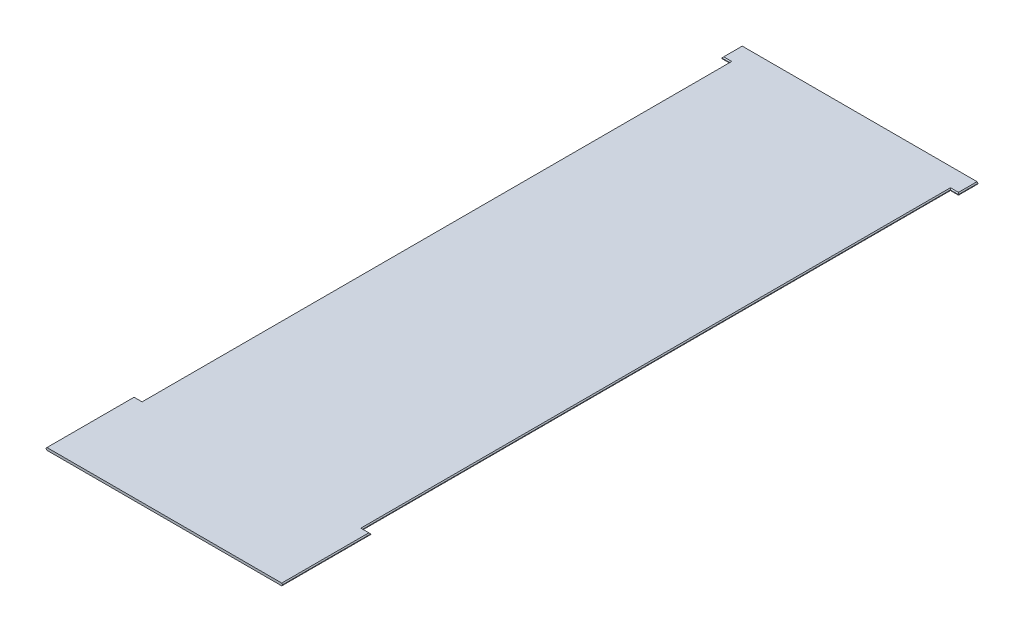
ISO-10303-21;
HEADER;
FILE_DESCRIPTION(('STEP AP214'),'2;1');
FILE_NAME('part.step','',(''),(''),'','','');
FILE_SCHEMA(('AUTOMOTIVE_DESIGN { 1 0 10303 214 1 1 1 1 }'));
ENDSEC;
DATA;
#1=APPLICATION_CONTEXT('core data for automotive mechanical design processes');
#2=APPLICATION_PROTOCOL_DEFINITION('international standard','automotive_design',2000,#1);
#3=PRODUCT_CONTEXT('',#1,'mechanical');
#4=PRODUCT('Part','Part','',(#3));
#5=PRODUCT_RELATED_PRODUCT_CATEGORY('part','',(#4));
#6=PRODUCT_DEFINITION_FORMATION('','',#4);
#7=PRODUCT_DEFINITION_CONTEXT('part definition',#1,'design');
#8=PRODUCT_DEFINITION('design','',#6,#7);
#9=PRODUCT_DEFINITION_SHAPE('','',#8);
#10=(LENGTH_UNIT() NAMED_UNIT(*) SI_UNIT(.MILLI.,.METRE.));
#11=(NAMED_UNIT(*) PLANE_ANGLE_UNIT() SI_UNIT($,.RADIAN.));
#12=(NAMED_UNIT(*) SI_UNIT($,.STERADIAN.) SOLID_ANGLE_UNIT());
#13=UNCERTAINTY_MEASURE_WITH_UNIT(LENGTH_MEASURE(1.E-05),#10,'distance_accuracy_value','');
#14=(GEOMETRIC_REPRESENTATION_CONTEXT(3) GLOBAL_UNCERTAINTY_ASSIGNED_CONTEXT((#13)) GLOBAL_UNIT_ASSIGNED_CONTEXT((#10,
#11,#12)) REPRESENTATION_CONTEXT('',''));
#15=CARTESIAN_POINT('',(0.,0.,0.));
#16=DIRECTION('',(0.,0.,1.));
#17=DIRECTION('',(1.,0.,0.));
#18=AXIS2_PLACEMENT_3D('',#15,#16,#17);
#19=CARTESIAN_POINT('',(553.261641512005,6.35,1566.92811259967));
#20=DIRECTION('',(-1.,0.,0.));
#21=DIRECTION('',(0.,0.,1.));
#22=AXIS2_PLACEMENT_3D('',#19,#20,#21);
#23=PLANE('',#22);
#24=DIRECTION('',(0.,-1.,0.));
#25=VECTOR('',#24,1.);
#26=CARTESIAN_POINT('',(553.261641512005,6.35,2018.12811259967));
#27=LINE('',#26,#25);
#28=CARTESIAN_POINT('',(553.261641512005,1.34999999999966,2018.12811259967));
#29=VERTEX_POINT('',#28);
#30=CARTESIAN_POINT('',(553.261641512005,-1.35000000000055,2018.12811259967));
#31=VERTEX_POINT('',#30);
#32=EDGE_CURVE('E236',#29,#31,#27,.T.);
#33=ORIENTED_EDGE('',*,*,#32,.T.);
#34=DIRECTION('',(0.,0.,-1.));
#35=VECTOR('',#34,1.);
#36=CARTESIAN_POINT('',(553.261641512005,-1.35000000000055,1566.92811259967));
#37=LINE('',#36,#35);
#38=CARTESIAN_POINT('',(553.261641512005,-1.35000000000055,1566.92811259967));
#39=VERTEX_POINT('',#38);
#40=EDGE_CURVE('E11',#31,#39,#37,.T.);
#41=ORIENTED_EDGE('',*,*,#40,.T.);
#42=DIRECTION('',(0.,-1.,0.));
#43=VECTOR('',#42,1.);
#44=CARTESIAN_POINT('',(553.261641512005,6.35,1566.92811259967));
#45=LINE('',#44,#43);
#46=CARTESIAN_POINT('',(553.261641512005,1.34999999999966,1566.92811259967));
#47=VERTEX_POINT('',#46);
#48=EDGE_CURVE('E243',#47,#39,#45,.T.);
#49=ORIENTED_EDGE('',*,*,#48,.F.);
#50=DIRECTION('',(0.,0.,1.));
#51=VECTOR('',#50,1.);
#52=CARTESIAN_POINT('',(553.261641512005,1.34999999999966,1566.92811259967));
#53=LINE('',#52,#51);
#54=EDGE_CURVE('E59',#47,#29,#53,.T.);
#55=ORIENTED_EDGE('',*,*,#54,.T.);
#56=EDGE_LOOP('',(#33,#41,#49,#55));
#57=FACE_BOUND('',#56,.T.);
#58=ADVANCED_FACE('F50',(#57),#23,.F.);
#59=CARTESIAN_POINT('',(512.161641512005,6.35,1566.92811259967));
#60=DIRECTION('',(0.,0.,1.));
#61=DIRECTION('',(1.,0.,0.));
#62=AXIS2_PLACEMENT_3D('',#59,#60,#61);
#63=PLANE('',#62);
#64=ORIENTED_EDGE('',*,*,#48,.T.);
#65=DIRECTION('',(-1.,0.,0.));
#66=VECTOR('',#65,1.);
#67=CARTESIAN_POINT('',(512.161641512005,-1.35000000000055,1566.92811259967));
#68=LINE('',#67,#66);
#69=CARTESIAN_POINT('',(512.161641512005,-1.35000000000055,1566.92811259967));
#70=VERTEX_POINT('',#69);
#71=EDGE_CURVE('E380',#39,#70,#68,.T.);
#72=ORIENTED_EDGE('',*,*,#71,.T.);
#73=DIRECTION('',(0.,-1.,0.));
#74=VECTOR('',#73,1.);
#75=CARTESIAN_POINT('',(512.161641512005,6.35,1566.92811259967));
#76=LINE('',#75,#74);
#77=CARTESIAN_POINT('',(512.161641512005,1.34999999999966,1566.92811259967));
#78=VERTEX_POINT('',#77);
#79=EDGE_CURVE('E248',#78,#70,#76,.T.);
#80=ORIENTED_EDGE('',*,*,#79,.F.);
#81=DIRECTION('',(1.,0.,0.));
#82=VECTOR('',#81,1.);
#83=CARTESIAN_POINT('',(512.161641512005,1.34999999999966,1566.92811259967));
#84=LINE('',#83,#82);
#85=EDGE_CURVE('E73',#78,#47,#84,.T.);
#86=ORIENTED_EDGE('',*,*,#85,.T.);
#87=EDGE_LOOP('',(#64,#72,#80,#86));
#88=FACE_BOUND('',#87,.T.);
#89=ADVANCED_FACE('F620',(#88),#63,.F.);
#90=CARTESIAN_POINT('',(512.161641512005,6.35,-1445.07188740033));
#91=DIRECTION('',(-1.,0.,0.));
#92=DIRECTION('',(0.,0.,1.));
#93=AXIS2_PLACEMENT_3D('',#90,#91,#92);
#94=PLANE('',#93);
#95=ORIENTED_EDGE('',*,*,#79,.T.);
#96=DIRECTION('',(0.,0.,-1.));
#97=VECTOR('',#96,1.);
#98=CARTESIAN_POINT('',(512.161641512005,-1.35000000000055,-1445.07188740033));
#99=LINE('',#98,#97);
#100=CARTESIAN_POINT('',(512.161641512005,-1.35000000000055,-1445.07188740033));
#101=VERTEX_POINT('',#100);
#102=EDGE_CURVE('E375',#70,#101,#99,.T.);
#103=ORIENTED_EDGE('',*,*,#102,.T.);
#104=DIRECTION('',(0.,-1.,0.));
#105=VECTOR('',#104,1.);
#106=CARTESIAN_POINT('',(512.161641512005,6.35,-1445.07188740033));
#107=LINE('',#106,#105);
#108=CARTESIAN_POINT('',(512.161641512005,1.34999999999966,-1445.07188740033));
#109=VERTEX_POINT('',#108);
#110=EDGE_CURVE('E493',#109,#101,#107,.T.);
#111=ORIENTED_EDGE('',*,*,#110,.F.);
#112=DIRECTION('',(0.,0.,1.));
#113=VECTOR('',#112,1.);
#114=CARTESIAN_POINT('',(512.161641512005,1.34999999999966,-1445.07188740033));
#115=LINE('',#114,#113);
#116=EDGE_CURVE('E367',#109,#78,#115,.T.);
#117=ORIENTED_EDGE('',*,*,#116,.T.);
#118=EDGE_LOOP('',(#95,#103,#111,#117));
#119=FACE_BOUND('',#118,.T.);
#120=ADVANCED_FACE('F498',(#119),#94,.F.);
#121=CARTESIAN_POINT('',(512.161641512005,6.35,-1445.07188740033));
#122=DIRECTION('',(0.,0.,-1.));
#123=DIRECTION('',(-1.,0.,0.));
#124=AXIS2_PLACEMENT_3D('',#121,#122,#123);
#125=PLANE('',#124);
#126=ORIENTED_EDGE('',*,*,#110,.T.);
#127=DIRECTION('',(1.,0.,0.));
#128=VECTOR('',#127,1.);
#129=CARTESIAN_POINT('',(553.261641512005,-1.35000000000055,-1445.07188740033));
#130=LINE('',#129,#128);
#131=CARTESIAN_POINT('',(553.261641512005,-1.35000000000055,-1445.07188740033));
#132=VERTEX_POINT('',#131);
#133=EDGE_CURVE('E366',#101,#132,#130,.T.);
#134=ORIENTED_EDGE('',*,*,#133,.T.);
#135=DIRECTION('',(0.,-1.,0.));
#136=VECTOR('',#135,1.);
#137=CARTESIAN_POINT('',(553.261641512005,6.35,-1445.07188740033));
#138=LINE('',#137,#136);
#139=CARTESIAN_POINT('',(553.261641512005,1.34999999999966,-1445.07188740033));
#140=VERTEX_POINT('',#139);
#141=EDGE_CURVE('E487',#140,#132,#138,.T.);
#142=ORIENTED_EDGE('',*,*,#141,.F.);
#143=DIRECTION('',(-1.,0.,0.));
#144=VECTOR('',#143,1.);
#145=CARTESIAN_POINT('',(512.161641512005,1.34999999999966,-1445.07188740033));
#146=LINE('',#145,#144);
#147=EDGE_CURVE('E361',#140,#109,#146,.T.);
#148=ORIENTED_EDGE('',*,*,#147,.T.);
#149=EDGE_LOOP('',(#126,#134,#142,#148));
#150=FACE_BOUND('',#149,.T.);
#151=ADVANCED_FACE('F520',(#150),#125,.F.);
#152=CARTESIAN_POINT('',(553.261641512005,6.35,-1445.07188740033));
#153=DIRECTION('',(-1.,0.,0.));
#154=DIRECTION('',(0.,0.,1.));
#155=AXIS2_PLACEMENT_3D('',#152,#153,#154);
#156=PLANE('',#155);
#157=ORIENTED_EDGE('',*,*,#141,.T.);
#158=DIRECTION('',(0.,0.,-1.));
#159=VECTOR('',#158,1.);
#160=CARTESIAN_POINT('',(553.261641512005,-1.35000000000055,-1545.0718874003));
#161=LINE('',#160,#159);
#162=CARTESIAN_POINT('',(553.261641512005,-1.35000000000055,-1545.0718874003));
#163=VERTEX_POINT('',#162);
#164=EDGE_CURVE('E360',#132,#163,#161,.T.);
#165=ORIENTED_EDGE('',*,*,#164,.T.);
#166=DIRECTION('',(0.,-1.,0.));
#167=VECTOR('',#166,1.);
#168=CARTESIAN_POINT('',(553.261641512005,6.35,-1545.0718874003));
#169=LINE('',#168,#167);
#170=CARTESIAN_POINT('',(553.261641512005,1.34999999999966,-1545.0718874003));
#171=VERTEX_POINT('',#170);
#172=EDGE_CURVE('E481',#171,#163,#169,.T.);
#173=ORIENTED_EDGE('',*,*,#172,.F.);
#174=DIRECTION('',(0.,0.,1.));
#175=VECTOR('',#174,1.);
#176=CARTESIAN_POINT('',(553.261641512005,1.34999999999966,-1445.07188740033));
#177=LINE('',#176,#175);
#178=EDGE_CURVE('E358',#171,#140,#177,.T.);
#179=ORIENTED_EDGE('',*,*,#178,.T.);
#180=EDGE_LOOP('',(#157,#165,#173,#179));
#181=FACE_BOUND('',#180,.T.);
#182=ADVANCED_FACE('F518',(#181),#156,.F.);
#183=CARTESIAN_POINT('',(-659.938358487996,6.35,-1545.0718874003));
#184=DIRECTION('',(0.,0.,1.));
#185=DIRECTION('',(1.,0.,0.));
#186=AXIS2_PLACEMENT_3D('',#183,#184,#185);
#187=PLANE('',#186);
#188=DIRECTION('',(-1.,0.,0.));
#189=VECTOR('',#188,1.);
#190=CARTESIAN_POINT('',(-659.938358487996,-6.35,-1545.0718874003));
#191=LINE('',#190,#189);
#192=CARTESIAN_POINT('',(548.261641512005,-6.35,-1545.0718874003));
#193=VERTEX_POINT('',#192);
#194=CARTESIAN_POINT('',(-654.938358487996,-6.35,-1545.0718874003));
#195=VERTEX_POINT('',#194);
#196=EDGE_CURVE('E399',#193,#195,#191,.T.);
#197=ORIENTED_EDGE('',*,*,#196,.T.);
#198=DIRECTION('',(-0.707106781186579,0.707106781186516,0.));
#199=VECTOR('',#198,1.);
#200=CARTESIAN_POINT('',(-659.938358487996,-1.35000000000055,-1545.0718874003));
#201=LINE('',#200,#199);
#202=CARTESIAN_POINT('',(-659.938358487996,-1.35000000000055,-1545.0718874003));
#203=VERTEX_POINT('',#202);
#204=EDGE_CURVE('E325',#195,#203,#201,.T.);
#205=ORIENTED_EDGE('',*,*,#204,.T.);
#206=DIRECTION('',(0.,-1.,0.));
#207=VECTOR('',#206,1.);
#208=CARTESIAN_POINT('',(-659.938358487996,6.35,-1545.0718874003));
#209=LINE('',#208,#207);
#210=CARTESIAN_POINT('',(-659.938358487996,1.34999999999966,-1545.0718874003));
#211=VERTEX_POINT('',#210);
#212=EDGE_CURVE('E479',#211,#203,#209,.T.);
#213=ORIENTED_EDGE('',*,*,#212,.F.);
#214=DIRECTION('',(-0.707106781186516,-0.707106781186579,0.));
#215=VECTOR('',#214,1.);
#216=CARTESIAN_POINT('',(-654.938358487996,6.35,-1545.0718874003));
#217=LINE('',#216,#215);
#218=CARTESIAN_POINT('',(-654.938358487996,6.35,-1545.0718874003));
#219=VERTEX_POINT('',#218);
#220=EDGE_CURVE('E316',#211,#219,#217,.F.);
#221=ORIENTED_EDGE('',*,*,#220,.T.);
#222=DIRECTION('',(-1.,0.,0.));
#223=VECTOR('',#222,1.);
#224=CARTESIAN_POINT('',(-659.938358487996,6.35,-1545.0718874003));
#225=LINE('',#224,#223);
#226=CARTESIAN_POINT('',(548.261641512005,6.35,-1545.0718874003));
#227=VERTEX_POINT('',#226);
#228=EDGE_CURVE('E459',#227,#219,#225,.T.);
#229=ORIENTED_EDGE('',*,*,#228,.F.);
#230=DIRECTION('',(-0.707106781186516,0.707106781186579,0.));
#231=VECTOR('',#230,1.);
#232=CARTESIAN_POINT('',(548.261641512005,6.35,-1545.0718874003));
#233=LINE('',#232,#231);
#234=EDGE_CURVE('E312',#227,#171,#233,.F.);
#235=ORIENTED_EDGE('',*,*,#234,.T.);
#236=ORIENTED_EDGE('',*,*,#172,.T.);
#237=DIRECTION('',(-0.707106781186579,-0.707106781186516,0.));
#238=VECTOR('',#237,1.);
#239=CARTESIAN_POINT('',(553.261641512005,-1.35000000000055,-1545.0718874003));
#240=LINE('',#239,#238);
#241=EDGE_CURVE('E317',#163,#193,#240,.T.);
#242=ORIENTED_EDGE('',*,*,#241,.T.);
#243=EDGE_LOOP('',(#197,#205,#213,#221,#229,#235,#236,#242));
#244=FACE_BOUND('',#243,.T.);
#245=ADVANCED_FACE('F573',(#244),#187,.F.);
#246=CARTESIAN_POINT('',(-659.938358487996,6.35,-1445.07188740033));
#247=DIRECTION('',(1.,0.,0.));
#248=DIRECTION('',(0.,0.,-1.));
#249=AXIS2_PLACEMENT_3D('',#246,#247,#248);
#250=PLANE('',#249);
#251=ORIENTED_EDGE('',*,*,#212,.T.);
#252=DIRECTION('',(0.,0.,1.));
#253=VECTOR('',#252,1.);
#254=CARTESIAN_POINT('',(-659.938358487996,-1.35000000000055,-1445.07188740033));
#255=LINE('',#254,#253);
#256=CARTESIAN_POINT('',(-659.938358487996,-1.35000000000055,-1445.07188740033));
#257=VERTEX_POINT('',#256);
#258=EDGE_CURVE('E309',#203,#257,#255,.T.);
#259=ORIENTED_EDGE('',*,*,#258,.T.);
#260=DIRECTION('',(0.,-1.,0.));
#261=VECTOR('',#260,1.);
#262=CARTESIAN_POINT('',(-659.938358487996,6.35,-1445.07188740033));
#263=LINE('',#262,#261);
#264=CARTESIAN_POINT('',(-659.938358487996,1.34999999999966,-1445.07188740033));
#265=VERTEX_POINT('',#264);
#266=EDGE_CURVE('E473',#265,#257,#263,.T.);
#267=ORIENTED_EDGE('',*,*,#266,.F.);
#268=DIRECTION('',(0.,0.,-1.));
#269=VECTOR('',#268,1.);
#270=CARTESIAN_POINT('',(-659.938358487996,1.34999999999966,-1445.07188740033));
#271=LINE('',#270,#269);
#272=EDGE_CURVE('E310',#265,#211,#271,.T.);
#273=ORIENTED_EDGE('',*,*,#272,.T.);
#274=EDGE_LOOP('',(#251,#259,#267,#273));
#275=FACE_BOUND('',#274,.T.);
#276=ADVANCED_FACE('F563',(#275),#250,.F.);
#277=CARTESIAN_POINT('',(-618.838358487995,6.35,-1445.07188740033));
#278=DIRECTION('',(0.,0.,-1.));
#279=DIRECTION('',(-1.,0.,0.));
#280=AXIS2_PLACEMENT_3D('',#277,#278,#279);
#281=PLANE('',#280);
#282=ORIENTED_EDGE('',*,*,#266,.T.);
#283=DIRECTION('',(1.,0.,0.));
#284=VECTOR('',#283,1.);
#285=CARTESIAN_POINT('',(-618.838358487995,-1.35000000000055,-1445.07188740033));
#286=LINE('',#285,#284);
#287=CARTESIAN_POINT('',(-618.838358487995,-1.35000000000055,-1445.07188740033));
#288=VERTEX_POINT('',#287);
#289=EDGE_CURVE('E302',#257,#288,#286,.T.);
#290=ORIENTED_EDGE('',*,*,#289,.T.);
#291=DIRECTION('',(0.,-1.,0.));
#292=VECTOR('',#291,1.);
#293=CARTESIAN_POINT('',(-618.838358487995,6.35,-1445.07188740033));
#294=LINE('',#293,#292);
#295=CARTESIAN_POINT('',(-618.838358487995,1.34999999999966,-1445.07188740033));
#296=VERTEX_POINT('',#295);
#297=EDGE_CURVE('E472',#296,#288,#294,.T.);
#298=ORIENTED_EDGE('',*,*,#297,.F.);
#299=DIRECTION('',(-1.,0.,0.));
#300=VECTOR('',#299,1.);
#301=CARTESIAN_POINT('',(-618.838358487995,1.34999999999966,-1445.07188740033));
#302=LINE('',#301,#300);
#303=EDGE_CURVE('E301',#296,#265,#302,.T.);
#304=ORIENTED_EDGE('',*,*,#303,.T.);
#305=EDGE_LOOP('',(#282,#290,#298,#304));
#306=FACE_BOUND('',#305,.T.);
#307=ADVANCED_FACE('F559',(#306),#281,.F.);
#308=CARTESIAN_POINT('',(-618.838358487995,6.35,1566.92811259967));
#309=DIRECTION('',(1.,0.,0.));
#310=DIRECTION('',(0.,0.,-1.));
#311=AXIS2_PLACEMENT_3D('',#308,#309,#310);
#312=PLANE('',#311);
#313=ORIENTED_EDGE('',*,*,#297,.T.);
#314=DIRECTION('',(0.,0.,1.));
#315=VECTOR('',#314,1.);
#316=CARTESIAN_POINT('',(-618.838358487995,-1.35000000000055,1566.92811259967));
#317=LINE('',#316,#315);
#318=CARTESIAN_POINT('',(-618.838358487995,-1.35000000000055,1566.92811259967));
#319=VERTEX_POINT('',#318);
#320=EDGE_CURVE('E296',#288,#319,#317,.T.);
#321=ORIENTED_EDGE('',*,*,#320,.T.);
#322=DIRECTION('',(0.,-1.,0.));
#323=VECTOR('',#322,1.);
#324=CARTESIAN_POINT('',(-618.838358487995,6.35,1566.92811259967));
#325=LINE('',#324,#323);
#326=CARTESIAN_POINT('',(-618.838358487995,1.34999999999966,1566.92811259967));
#327=VERTEX_POINT('',#326);
#328=EDGE_CURVE('E470',#327,#319,#325,.T.);
#329=ORIENTED_EDGE('',*,*,#328,.F.);
#330=DIRECTION('',(0.,0.,-1.));
#331=VECTOR('',#330,1.);
#332=CARTESIAN_POINT('',(-618.838358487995,1.34999999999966,1566.92811259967));
#333=LINE('',#332,#331);
#334=EDGE_CURVE('E294',#327,#296,#333,.T.);
#335=ORIENTED_EDGE('',*,*,#334,.T.);
#336=EDGE_LOOP('',(#313,#321,#329,#335));
#337=FACE_BOUND('',#336,.T.);
#338=ADVANCED_FACE('F548',(#337),#312,.F.);
#339=CARTESIAN_POINT('',(-659.938358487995,6.35,1566.92811259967));
#340=DIRECTION('',(0.,0.,1.));
#341=DIRECTION('',(1.,0.,0.));
#342=AXIS2_PLACEMENT_3D('',#339,#340,#341);
#343=PLANE('',#342);
#344=ORIENTED_EDGE('',*,*,#328,.T.);
#345=DIRECTION('',(-1.,0.,0.));
#346=VECTOR('',#345,1.);
#347=CARTESIAN_POINT('',(-659.938358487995,-1.35000000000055,1566.92811259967));
#348=LINE('',#347,#346);
#349=CARTESIAN_POINT('',(-659.938358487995,-1.35000000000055,1566.92811259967));
#350=VERTEX_POINT('',#349);
#351=EDGE_CURVE('E292',#319,#350,#348,.T.);
#352=ORIENTED_EDGE('',*,*,#351,.T.);
#353=DIRECTION('',(0.,-1.,0.));
#354=VECTOR('',#353,1.);
#355=CARTESIAN_POINT('',(-659.938358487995,6.35,1566.92811259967));
#356=LINE('',#355,#354);
#357=CARTESIAN_POINT('',(-659.938358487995,1.34999999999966,1566.92811259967));
#358=VERTEX_POINT('',#357);
#359=EDGE_CURVE('E232',#358,#350,#356,.T.);
#360=ORIENTED_EDGE('',*,*,#359,.F.);
#361=DIRECTION('',(1.,0.,0.));
#362=VECTOR('',#361,1.);
#363=CARTESIAN_POINT('',(-659.938358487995,1.34999999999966,1566.92811259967));
#364=LINE('',#363,#362);
#365=EDGE_CURVE('E289',#358,#327,#364,.T.);
#366=ORIENTED_EDGE('',*,*,#365,.T.);
#367=EDGE_LOOP('',(#344,#352,#360,#366));
#368=FACE_BOUND('',#367,.T.);
#369=ADVANCED_FACE('F545',(#368),#343,.F.);
#370=CARTESIAN_POINT('',(-659.938358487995,6.35,2018.12811259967));
#371=DIRECTION('',(1.,0.,0.));
#372=DIRECTION('',(0.,0.,-1.));
#373=AXIS2_PLACEMENT_3D('',#370,#371,#372);
#374=PLANE('',#373);
#375=ORIENTED_EDGE('',*,*,#359,.T.);
#376=DIRECTION('',(0.,0.,1.));
#377=VECTOR('',#376,1.);
#378=CARTESIAN_POINT('',(-659.938358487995,-1.35000000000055,2018.12811259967));
#379=LINE('',#378,#377);
#380=CARTESIAN_POINT('',(-659.938358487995,-1.35000000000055,2018.12811259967));
#381=VERTEX_POINT('',#380);
#382=EDGE_CURVE('E231',#350,#381,#379,.T.);
#383=ORIENTED_EDGE('',*,*,#382,.T.);
#384=DIRECTION('',(0.,-1.,0.));
#385=VECTOR('',#384,1.);
#386=CARTESIAN_POINT('',(-659.938358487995,6.35,2018.12811259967));
#387=LINE('',#386,#385);
#388=CARTESIAN_POINT('',(-659.938358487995,1.34999999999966,2018.12811259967));
#389=VERTEX_POINT('',#388);
#390=EDGE_CURVE('E213',#389,#381,#387,.T.);
#391=ORIENTED_EDGE('',*,*,#390,.F.);
#392=DIRECTION('',(0.,0.,-1.));
#393=VECTOR('',#392,1.);
#394=CARTESIAN_POINT('',(-659.938358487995,1.34999999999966,2018.12811259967));
#395=LINE('',#394,#393);
#396=EDGE_CURVE('E229',#389,#358,#395,.T.);
#397=ORIENTED_EDGE('',*,*,#396,.T.);
#398=EDGE_LOOP('',(#375,#383,#391,#397));
#399=FACE_BOUND('',#398,.T.);
#400=ADVANCED_FACE('F230',(#399),#374,.F.);
#401=CARTESIAN_POINT('',(553.261641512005,6.35,2018.12811259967));
#402=DIRECTION('',(0.,0.,-1.));
#403=DIRECTION('',(-1.,0.,0.));
#404=AXIS2_PLACEMENT_3D('',#401,#402,#403);
#405=PLANE('',#404);
#406=ORIENTED_EDGE('',*,*,#390,.T.);
#407=DIRECTION('',(0.707106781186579,-0.707106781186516,0.));
#408=VECTOR('',#407,1.);
#409=CARTESIAN_POINT('',(-659.938358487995,-1.35000000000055,2018.12811259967));
#410=LINE('',#409,#408);
#411=CARTESIAN_POINT('',(-654.938358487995,-6.35,2018.12811259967));
#412=VERTEX_POINT('',#411);
#413=EDGE_CURVE('E221',#381,#412,#410,.T.);
#414=ORIENTED_EDGE('',*,*,#413,.T.);
#415=DIRECTION('',(1.,0.,0.));
#416=VECTOR('',#415,1.);
#417=CARTESIAN_POINT('',(553.261641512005,-6.35,2018.12811259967));
#418=LINE('',#417,#416);
#419=CARTESIAN_POINT('',(548.261641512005,-6.35,2018.12811259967));
#420=VERTEX_POINT('',#419);
#421=EDGE_CURVE('E465',#412,#420,#418,.T.);
#422=ORIENTED_EDGE('',*,*,#421,.T.);
#423=DIRECTION('',(0.707106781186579,0.707106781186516,0.));
#424=VECTOR('',#423,1.);
#425=CARTESIAN_POINT('',(553.261641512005,-1.35000000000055,2018.12811259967));
#426=LINE('',#425,#424);
#427=EDGE_CURVE('E224',#420,#31,#426,.T.);
#428=ORIENTED_EDGE('',*,*,#427,.T.);
#429=ORIENTED_EDGE('',*,*,#32,.F.);
#430=DIRECTION('',(0.707106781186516,-0.707106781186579,0.));
#431=VECTOR('',#430,1.);
#432=CARTESIAN_POINT('',(548.261641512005,6.35,2018.12811259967));
#433=LINE('',#432,#431);
#434=CARTESIAN_POINT('',(548.261641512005,6.35,2018.12811259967));
#435=VERTEX_POINT('',#434);
#436=EDGE_CURVE('E250',#29,#435,#433,.F.);
#437=ORIENTED_EDGE('',*,*,#436,.T.);
#438=DIRECTION('',(1.,0.,0.));
#439=VECTOR('',#438,1.);
#440=CARTESIAN_POINT('',(553.261641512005,6.35,2018.12811259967));
#441=LINE('',#440,#439);
#442=CARTESIAN_POINT('',(-654.938358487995,6.35,2018.12811259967));
#443=VERTEX_POINT('',#442);
#444=EDGE_CURVE('E220',#443,#435,#441,.T.);
#445=ORIENTED_EDGE('',*,*,#444,.F.);
#446=DIRECTION('',(0.707106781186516,0.707106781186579,0.));
#447=VECTOR('',#446,1.);
#448=CARTESIAN_POINT('',(-654.938358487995,6.35,2018.12811259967));
#449=LINE('',#448,#447);
#450=EDGE_CURVE('E215',#443,#389,#449,.F.);
#451=ORIENTED_EDGE('',*,*,#450,.T.);
#452=EDGE_LOOP('',(#406,#414,#422,#428,#429,#437,#445,#451));
#453=FACE_BOUND('',#452,.T.);
#454=ADVANCED_FACE('F211',(#453),#405,.F.);
#455=CARTESIAN_POINT('',(0.,6.35,0.));
#456=DIRECTION('',(0.,-1.,0.));
#457=DIRECTION('',(0.,0.,-1.));
#458=AXIS2_PLACEMENT_3D('',#455,#456,#457);
#459=PLANE('',#458);
#460=DIRECTION('',(-1.,0.,0.));
#461=VECTOR('',#460,1.);
#462=CARTESIAN_POINT('',(0.,6.35,1571.92811259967));
#463=LINE('',#462,#461);
#464=CARTESIAN_POINT('',(-613.838358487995,6.35,1571.92811259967));
#465=VERTEX_POINT('',#464);
#466=CARTESIAN_POINT('',(-654.938358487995,6.35,1571.92811259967));
#467=VERTEX_POINT('',#466);
#468=EDGE_CURVE('E347',#465,#467,#463,.T.);
#469=ORIENTED_EDGE('',*,*,#468,.T.);
#470=DIRECTION('',(0.,0.,1.));
#471=VECTOR('',#470,1.);
#472=CARTESIAN_POINT('',(-654.938358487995,6.35,0.));
#473=LINE('',#472,#471);
#474=EDGE_CURVE('E351',#467,#443,#473,.T.);
#475=ORIENTED_EDGE('',*,*,#474,.T.);
#476=ORIENTED_EDGE('',*,*,#444,.T.);
#477=DIRECTION('',(0.,0.,-1.));
#478=VECTOR('',#477,1.);
#479=CARTESIAN_POINT('',(548.261641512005,6.35,0.));
#480=LINE('',#479,#478);
#481=CARTESIAN_POINT('',(548.261641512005,6.35,1571.92811259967));
#482=VERTEX_POINT('',#481);
#483=EDGE_CURVE('E323',#435,#482,#480,.T.);
#484=ORIENTED_EDGE('',*,*,#483,.T.);
#485=DIRECTION('',(-1.,0.,0.));
#486=VECTOR('',#485,1.);
#487=CARTESIAN_POINT('',(0.,6.35,1571.92811259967));
#488=LINE('',#487,#486);
#489=CARTESIAN_POINT('',(507.161641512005,6.35,1571.92811259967));
#490=VERTEX_POINT('',#489);
#491=EDGE_CURVE('E326',#482,#490,#488,.T.);
#492=ORIENTED_EDGE('',*,*,#491,.T.);
#493=DIRECTION('',(0.,0.,-1.));
#494=VECTOR('',#493,1.);
#495=CARTESIAN_POINT('',(507.161641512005,6.35,0.));
#496=LINE('',#495,#494);
#497=CARTESIAN_POINT('',(507.161641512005,6.35,-1450.07188740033));
#498=VERTEX_POINT('',#497);
#499=EDGE_CURVE('E333',#490,#498,#496,.T.);
#500=ORIENTED_EDGE('',*,*,#499,.T.);
#501=DIRECTION('',(1.,0.,0.));
#502=VECTOR('',#501,1.);
#503=CARTESIAN_POINT('',(0.,6.35,-1450.07188740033));
#504=LINE('',#503,#502);
#505=CARTESIAN_POINT('',(548.261641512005,6.35,-1450.07188740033));
#506=VERTEX_POINT('',#505);
#507=EDGE_CURVE('E334',#498,#506,#504,.T.);
#508=ORIENTED_EDGE('',*,*,#507,.T.);
#509=DIRECTION('',(0.,0.,-1.));
#510=VECTOR('',#509,1.);
#511=CARTESIAN_POINT('',(548.261641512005,6.35,0.));
#512=LINE('',#511,#510);
#513=EDGE_CURVE('E340',#506,#227,#512,.T.);
#514=ORIENTED_EDGE('',*,*,#513,.T.);
#515=ORIENTED_EDGE('',*,*,#228,.T.);
#516=DIRECTION('',(0.,0.,1.));
#517=VECTOR('',#516,1.);
#518=CARTESIAN_POINT('',(-654.938358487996,6.35,0.));
#519=LINE('',#518,#517);
#520=CARTESIAN_POINT('',(-654.938358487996,6.35,-1450.07188740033));
#521=VERTEX_POINT('',#520);
#522=EDGE_CURVE('E342',#219,#521,#519,.T.);
#523=ORIENTED_EDGE('',*,*,#522,.T.);
#524=DIRECTION('',(1.,0.,0.));
#525=VECTOR('',#524,1.);
#526=CARTESIAN_POINT('',(0.,6.35,-1450.07188740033));
#527=LINE('',#526,#525);
#528=CARTESIAN_POINT('',(-613.838358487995,6.35,-1450.07188740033));
#529=VERTEX_POINT('',#528);
#530=EDGE_CURVE('E341',#521,#529,#527,.T.);
#531=ORIENTED_EDGE('',*,*,#530,.T.);
#532=DIRECTION('',(0.,0.,1.));
#533=VECTOR('',#532,1.);
#534=CARTESIAN_POINT('',(-613.838358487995,6.35,0.));
#535=LINE('',#534,#533);
#536=EDGE_CURVE('E350',#529,#465,#535,.T.);
#537=ORIENTED_EDGE('',*,*,#536,.T.);
#538=EDGE_LOOP('',(#469,#475,#476,#484,#492,#500,#508,#514,#515,#523,#531,#537));
#539=FACE_BOUND('',#538,.T.);
#540=ADVANCED_FACE('F531',(#539),#459,.F.);
#541=CARTESIAN_POINT('',(0.,-6.35,0.));
#542=DIRECTION('',(0.,-1.,0.));
#543=DIRECTION('',(0.,0.,-1.));
#544=AXIS2_PLACEMENT_3D('',#541,#542,#543);
#545=PLANE('',#544);
#546=ORIENTED_EDGE('',*,*,#421,.F.);
#547=DIRECTION('',(0.,0.,-1.));
#548=VECTOR('',#547,1.);
#549=CARTESIAN_POINT('',(-654.938358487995,-6.35,1566.92811259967));
#550=LINE('',#549,#548);
#551=CARTESIAN_POINT('',(-654.938358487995,-6.35,1571.92811259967));
#552=VERTEX_POINT('',#551);
#553=EDGE_CURVE('E288',#412,#552,#550,.T.);
#554=ORIENTED_EDGE('',*,*,#553,.T.);
#555=DIRECTION('',(1.,0.,0.));
#556=VECTOR('',#555,1.);
#557=CARTESIAN_POINT('',(-618.838358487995,-6.35,1571.92811259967));
#558=LINE('',#557,#556);
#559=CARTESIAN_POINT('',(-613.838358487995,-6.35,1571.92811259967));
#560=VERTEX_POINT('',#559);
#561=EDGE_CURVE('E281',#552,#560,#558,.T.);
#562=ORIENTED_EDGE('',*,*,#561,.T.);
#563=DIRECTION('',(0.,0.,-1.));
#564=VECTOR('',#563,1.);
#565=CARTESIAN_POINT('',(-613.838358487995,-6.35,-1445.07188740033));
#566=LINE('',#565,#564);
#567=CARTESIAN_POINT('',(-613.838358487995,-6.35,-1450.07188740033));
#568=VERTEX_POINT('',#567);
#569=EDGE_CURVE('E278',#560,#568,#566,.T.);
#570=ORIENTED_EDGE('',*,*,#569,.T.);
#571=DIRECTION('',(-1.,0.,0.));
#572=VECTOR('',#571,1.);
#573=CARTESIAN_POINT('',(-659.938358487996,-6.35,-1450.07188740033));
#574=LINE('',#573,#572);
#575=CARTESIAN_POINT('',(-654.938358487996,-6.35,-1450.07188740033));
#576=VERTEX_POINT('',#575);
#577=EDGE_CURVE('E280',#568,#576,#574,.T.);
#578=ORIENTED_EDGE('',*,*,#577,.T.);
#579=DIRECTION('',(0.,0.,-1.));
#580=VECTOR('',#579,1.);
#581=CARTESIAN_POINT('',(-654.938358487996,-6.35,-1545.0718874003));
#582=LINE('',#581,#580);
#583=EDGE_CURVE('E274',#576,#195,#582,.T.);
#584=ORIENTED_EDGE('',*,*,#583,.T.);
#585=ORIENTED_EDGE('',*,*,#196,.F.);
#586=DIRECTION('',(0.,0.,1.));
#587=VECTOR('',#586,1.);
#588=CARTESIAN_POINT('',(548.261641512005,-6.35,-1445.07188740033));
#589=LINE('',#588,#587);
#590=CARTESIAN_POINT('',(548.261641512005,-6.35,-1450.07188740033));
#591=VERTEX_POINT('',#590);
#592=EDGE_CURVE('E272',#193,#591,#589,.T.);
#593=ORIENTED_EDGE('',*,*,#592,.T.);
#594=DIRECTION('',(-1.,0.,0.));
#595=VECTOR('',#594,1.);
#596=CARTESIAN_POINT('',(512.161641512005,-6.35,-1450.07188740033));
#597=LINE('',#596,#595);
#598=CARTESIAN_POINT('',(507.161641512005,-6.35,-1450.07188740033));
#599=VERTEX_POINT('',#598);
#600=EDGE_CURVE('E266',#591,#599,#597,.T.);
#601=ORIENTED_EDGE('',*,*,#600,.T.);
#602=DIRECTION('',(0.,0.,1.));
#603=VECTOR('',#602,1.);
#604=CARTESIAN_POINT('',(507.161641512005,-6.35,1566.92811259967));
#605=LINE('',#604,#603);
#606=CARTESIAN_POINT('',(507.161641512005,-6.35,1571.92811259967));
#607=VERTEX_POINT('',#606);
#608=EDGE_CURVE('E262',#599,#607,#605,.T.);
#609=ORIENTED_EDGE('',*,*,#608,.T.);
#610=DIRECTION('',(1.,0.,0.));
#611=VECTOR('',#610,1.);
#612=CARTESIAN_POINT('',(553.261641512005,-6.35,1571.92811259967));
#613=LINE('',#612,#611);
#614=CARTESIAN_POINT('',(548.261641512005,-6.35,1571.92811259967));
#615=VERTEX_POINT('',#614);
#616=EDGE_CURVE('E265',#607,#615,#613,.T.);
#617=ORIENTED_EDGE('',*,*,#616,.T.);
#618=DIRECTION('',(0.,0.,1.));
#619=VECTOR('',#618,1.);
#620=CARTESIAN_POINT('',(548.261641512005,-6.35,2018.12811259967));
#621=LINE('',#620,#619);
#622=EDGE_CURVE('E256',#615,#420,#621,.T.);
#623=ORIENTED_EDGE('',*,*,#622,.T.);
#624=EDGE_LOOP('',(#546,#554,#562,#570,#578,#584,#585,#593,#601,#609,#617,#623));
#625=FACE_BOUND('',#624,.T.);
#626=ADVANCED_FACE('F604',(#625),#545,.T.);
#627=CARTESIAN_POINT('',(-659.938358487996,-1.35000000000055,-1445.07188740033));
#628=DIRECTION('',(-0.707106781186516,-0.707106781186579,0.));
#629=DIRECTION('',(0.,0.,-1.));
#630=AXIS2_PLACEMENT_3D('',#627,#628,#629);
#631=PLANE('',#630);
#632=ORIENTED_EDGE('',*,*,#204,.F.);
#633=ORIENTED_EDGE('',*,*,#583,.F.);
#634=DIRECTION('',(-0.577350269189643,0.577350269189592,0.577350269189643));
#635=VECTOR('',#634,1.);
#636=CARTESIAN_POINT('',(-659.938358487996,-1.35000000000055,-1445.07188740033));
#637=LINE('',#636,#635);
#638=EDGE_CURVE('E392',#257,#576,#637,.F.);
#639=ORIENTED_EDGE('',*,*,#638,.F.);
#640=ORIENTED_EDGE('',*,*,#258,.F.);
#641=EDGE_LOOP('',(#632,#633,#639,#640));
#642=FACE_BOUND('',#641,.T.);
#643=ADVANCED_FACE('F583',(#642),#631,.T.);
#644=CARTESIAN_POINT('',(-618.838358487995,-1.35000000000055,-1445.07188740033));
#645=DIRECTION('',(0.,-0.707106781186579,0.707106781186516));
#646=DIRECTION('',(-1.,0.,0.));
#647=AXIS2_PLACEMENT_3D('',#644,#645,#646);
#648=PLANE('',#647);
#649=ORIENTED_EDGE('',*,*,#638,.T.);
#650=ORIENTED_EDGE('',*,*,#577,.F.);
#651=DIRECTION('',(-0.577350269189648,0.577350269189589,0.57735026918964));
#652=VECTOR('',#651,1.);
#653=CARTESIAN_POINT('',(-1622.83835848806,1002.64999999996,-441.071887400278));
#654=LINE('',#653,#652);
#655=EDGE_CURVE('E393',#288,#568,#654,.F.);
#656=ORIENTED_EDGE('',*,*,#655,.F.);
#657=ORIENTED_EDGE('',*,*,#289,.F.);
#658=EDGE_LOOP('',(#649,#650,#656,#657));
#659=FACE_BOUND('',#658,.T.);
#660=ADVANCED_FACE('F587',(#659),#648,.T.);
#661=CARTESIAN_POINT('',(-618.838358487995,-1.35000000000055,1566.92811259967));
#662=DIRECTION('',(-0.707106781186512,-0.707106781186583,0.));
#663=DIRECTION('',(0.,0.,-1.));
#664=AXIS2_PLACEMENT_3D('',#661,#662,#663);
#665=PLANE('',#664);
#666=ORIENTED_EDGE('',*,*,#655,.T.);
#667=ORIENTED_EDGE('',*,*,#569,.F.);
#668=DIRECTION('',(-0.577350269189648,0.577350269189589,-0.57735026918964));
#669=VECTOR('',#668,1.);
#670=CARTESIAN_POINT('',(-632.538358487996,12.3499999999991,1553.22811259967));
#671=LINE('',#670,#669);
#672=EDGE_CURVE('E387',#319,#560,#671,.F.);
#673=ORIENTED_EDGE('',*,*,#672,.F.);
#674=ORIENTED_EDGE('',*,*,#320,.F.);
#675=EDGE_LOOP('',(#666,#667,#673,#674));
#676=FACE_BOUND('',#675,.T.);
#677=ADVANCED_FACE('F591',(#676),#665,.T.);
#678=CARTESIAN_POINT('',(-659.938358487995,-1.35000000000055,1566.92811259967));
#679=DIRECTION('',(0.,-0.707106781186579,-0.707106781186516));
#680=DIRECTION('',(1.,0.,0.));
#681=AXIS2_PLACEMENT_3D('',#678,#679,#680);
#682=PLANE('',#681);
#683=ORIENTED_EDGE('',*,*,#672,.T.);
#684=ORIENTED_EDGE('',*,*,#561,.F.);
#685=DIRECTION('',(-0.577350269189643,0.577350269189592,-0.577350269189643));
#686=VECTOR('',#685,1.);
#687=CARTESIAN_POINT('',(-659.938358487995,-1.35000000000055,1566.92811259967));
#688=LINE('',#687,#686);
#689=EDGE_CURVE('E385',#350,#552,#688,.F.);
#690=ORIENTED_EDGE('',*,*,#689,.F.);
#691=ORIENTED_EDGE('',*,*,#351,.F.);
#692=EDGE_LOOP('',(#683,#684,#690,#691));
#693=FACE_BOUND('',#692,.T.);
#694=ADVANCED_FACE('F596',(#693),#682,.T.);
#695=CARTESIAN_POINT('',(-659.938358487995,-1.35000000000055,2018.12811259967));
#696=DIRECTION('',(-0.707106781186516,-0.707106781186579,0.));
#697=DIRECTION('',(0.,0.,-1.));
#698=AXIS2_PLACEMENT_3D('',#695,#696,#697);
#699=PLANE('',#698);
#700=ORIENTED_EDGE('',*,*,#689,.T.);
#701=ORIENTED_EDGE('',*,*,#553,.F.);
#702=ORIENTED_EDGE('',*,*,#413,.F.);
#703=ORIENTED_EDGE('',*,*,#382,.F.);
#704=EDGE_LOOP('',(#700,#701,#702,#703));
#705=FACE_BOUND('',#704,.T.);
#706=ADVANCED_FACE('F602',(#705),#699,.T.);
#707=CARTESIAN_POINT('',(-654.938358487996,6.35,0.));
#708=DIRECTION('',(0.707106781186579,-0.707106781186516,0.));
#709=DIRECTION('',(0.,0.,1.));
#710=AXIS2_PLACEMENT_3D('',#707,#708,#709);
#711=PLANE('',#710);
#712=ORIENTED_EDGE('',*,*,#220,.F.);
#713=ORIENTED_EDGE('',*,*,#272,.F.);
#714=DIRECTION('',(0.577350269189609,0.57735026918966,-0.577350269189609));
#715=VECTOR('',#714,1.);
#716=CARTESIAN_POINT('',(-1138.29565428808,-477.007295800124,-966.714591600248));
#717=LINE('',#716,#715);
#718=EDGE_CURVE('E390',#521,#265,#717,.F.);
#719=ORIENTED_EDGE('',*,*,#718,.F.);
#720=ORIENTED_EDGE('',*,*,#522,.F.);
#721=EDGE_LOOP('',(#712,#713,#719,#720));
#722=FACE_BOUND('',#721,.T.);
#723=ADVANCED_FACE('F568',(#722),#711,.F.);
#724=CARTESIAN_POINT('',(0.,6.35,-1450.07188740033));
#725=DIRECTION('',(0.,-0.707106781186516,-0.707106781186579));
#726=DIRECTION('',(1.,0.,0.));
#727=AXIS2_PLACEMENT_3D('',#724,#725,#726);
#728=PLANE('',#727);
#729=ORIENTED_EDGE('',*,*,#718,.T.);
#730=ORIENTED_EDGE('',*,*,#303,.F.);
#731=DIRECTION('',(0.577350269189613,0.577350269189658,-0.577350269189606));
#732=VECTOR('',#731,1.);
#733=CARTESIAN_POINT('',(-1097.19565428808,-477.00729580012,-966.714591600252));
#734=LINE('',#733,#732);
#735=EDGE_CURVE('E410',#529,#296,#734,.F.);
#736=ORIENTED_EDGE('',*,*,#735,.F.);
#737=ORIENTED_EDGE('',*,*,#530,.F.);
#738=EDGE_LOOP('',(#729,#730,#736,#737));
#739=FACE_BOUND('',#738,.T.);
#740=ADVANCED_FACE('F554',(#739),#728,.F.);
#741=CARTESIAN_POINT('',(-613.838358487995,6.35,0.));
#742=DIRECTION('',(0.707106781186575,-0.707106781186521,0.));
#743=DIRECTION('',(0.,0.,1.));
#744=AXIS2_PLACEMENT_3D('',#741,#742,#743);
#745=PLANE('',#744);
#746=ORIENTED_EDGE('',*,*,#735,.T.);
#747=ORIENTED_EDGE('',*,*,#334,.F.);
#748=DIRECTION('',(0.577350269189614,0.577350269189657,0.577350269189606));
#749=VECTOR('',#748,1.);
#750=CARTESIAN_POINT('',(-409.225572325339,210.962786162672,1776.54089876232));
#751=LINE('',#750,#749);
#752=EDGE_CURVE('E405',#465,#327,#751,.F.);
#753=ORIENTED_EDGE('',*,*,#752,.F.);
#754=ORIENTED_EDGE('',*,*,#536,.F.);
#755=EDGE_LOOP('',(#746,#747,#753,#754));
#756=FACE_BOUND('',#755,.T.);
#757=ADVANCED_FACE('F547',(#756),#745,.F.);
#758=CARTESIAN_POINT('',(0.,6.35,1571.92811259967));
#759=DIRECTION('',(0.,-0.707106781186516,0.707106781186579));
#760=DIRECTION('',(-1.,0.,0.));
#761=AXIS2_PLACEMENT_3D('',#758,#759,#760);
#762=PLANE('',#761);
#763=ORIENTED_EDGE('',*,*,#752,.T.);
#764=ORIENTED_EDGE('',*,*,#365,.F.);
#765=DIRECTION('',(0.577350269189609,0.57735026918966,0.577350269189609));
#766=VECTOR('',#765,1.);
#767=CARTESIAN_POINT('',(-436.625572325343,224.662786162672,1790.24089876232));
#768=LINE('',#767,#766);
#769=EDGE_CURVE('E241',#467,#358,#768,.F.);
#770=ORIENTED_EDGE('',*,*,#769,.F.);
#771=ORIENTED_EDGE('',*,*,#468,.F.);
#772=EDGE_LOOP('',(#763,#764,#770,#771));
#773=FACE_BOUND('',#772,.T.);
#774=ADVANCED_FACE('F536',(#773),#762,.F.);
#775=CARTESIAN_POINT('',(-654.938358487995,6.35,0.));
#776=DIRECTION('',(0.707106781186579,-0.707106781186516,0.));
#777=DIRECTION('',(0.,0.,1.));
#778=AXIS2_PLACEMENT_3D('',#775,#776,#777);
#779=PLANE('',#778);
#780=ORIENTED_EDGE('',*,*,#769,.T.);
#781=ORIENTED_EDGE('',*,*,#396,.F.);
#782=ORIENTED_EDGE('',*,*,#450,.F.);
#783=ORIENTED_EDGE('',*,*,#474,.F.);
#784=EDGE_LOOP('',(#780,#781,#782,#783));
#785=FACE_BOUND('',#784,.T.);
#786=ADVANCED_FACE('F237',(#785),#779,.F.);
#787=CARTESIAN_POINT('',(553.261641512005,-1.35000000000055,1566.92811259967));
#788=DIRECTION('',(0.707106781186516,-0.707106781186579,0.));
#789=DIRECTION('',(0.,0.,1.));
#790=AXIS2_PLACEMENT_3D('',#787,#788,#789);
#791=PLANE('',#790);
#792=ORIENTED_EDGE('',*,*,#427,.F.);
#793=ORIENTED_EDGE('',*,*,#622,.F.);
#794=DIRECTION('',(0.577350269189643,0.577350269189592,-0.577350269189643));
#795=VECTOR('',#794,1.);
#796=CARTESIAN_POINT('',(553.261641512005,-1.35000000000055,1566.92811259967));
#797=LINE('',#796,#795);
#798=EDGE_CURVE('E401',#39,#615,#797,.F.);
#799=ORIENTED_EDGE('',*,*,#798,.F.);
#800=ORIENTED_EDGE('',*,*,#40,.F.);
#801=EDGE_LOOP('',(#792,#793,#799,#800));
#802=FACE_BOUND('',#801,.T.);
#803=ADVANCED_FACE('F610',(#802),#791,.T.);
#804=CARTESIAN_POINT('',(512.161641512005,-1.35000000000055,1566.92811259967));
#805=DIRECTION('',(0.,-0.707106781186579,-0.707106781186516));
#806=DIRECTION('',(1.,0.,0.));
#807=AXIS2_PLACEMENT_3D('',#804,#805,#806);
#808=PLANE('',#807);
#809=ORIENTED_EDGE('',*,*,#798,.T.);
#810=ORIENTED_EDGE('',*,*,#616,.F.);
#811=DIRECTION('',(0.577350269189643,0.577350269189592,-0.577350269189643));
#812=VECTOR('',#811,1.);
#813=CARTESIAN_POINT('',(1516.16164151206,1002.64999999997,562.928112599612));
#814=LINE('',#813,#812);
#815=EDGE_CURVE('E422',#70,#607,#814,.F.);
#816=ORIENTED_EDGE('',*,*,#815,.F.);
#817=ORIENTED_EDGE('',*,*,#71,.F.);
#818=EDGE_LOOP('',(#809,#810,#816,#817));
#819=FACE_BOUND('',#818,.T.);
#820=ADVANCED_FACE('F502',(#819),#808,.T.);
#821=CARTESIAN_POINT('',(512.161641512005,-1.35000000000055,-1445.07188740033));
#822=DIRECTION('',(0.707106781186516,-0.707106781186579,0.));
#823=DIRECTION('',(0.,0.,1.));
#824=AXIS2_PLACEMENT_3D('',#821,#822,#823);
#825=PLANE('',#824);
#826=ORIENTED_EDGE('',*,*,#815,.T.);
#827=ORIENTED_EDGE('',*,*,#608,.F.);
#828=DIRECTION('',(0.577350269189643,0.577350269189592,0.577350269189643));
#829=VECTOR('',#828,1.);
#830=CARTESIAN_POINT('',(512.161641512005,-1.35000000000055,-1445.07188740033));
#831=LINE('',#830,#829);
#832=EDGE_CURVE('E416',#101,#599,#831,.F.);
#833=ORIENTED_EDGE('',*,*,#832,.F.);
#834=ORIENTED_EDGE('',*,*,#102,.F.);
#835=EDGE_LOOP('',(#826,#827,#833,#834));
#836=FACE_BOUND('',#835,.T.);
#837=ADVANCED_FACE('F507',(#836),#825,.T.);
#838=CARTESIAN_POINT('',(512.161641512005,-1.35000000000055,-1445.07188740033));
#839=DIRECTION('',(0.,-0.707106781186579,0.707106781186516));
#840=DIRECTION('',(-1.,0.,0.));
#841=AXIS2_PLACEMENT_3D('',#838,#839,#840);
#842=PLANE('',#841);
#843=ORIENTED_EDGE('',*,*,#832,.T.);
#844=ORIENTED_EDGE('',*,*,#600,.F.);
#845=DIRECTION('',(0.577350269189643,0.577350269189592,0.577350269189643));
#846=VECTOR('',#845,1.);
#847=CARTESIAN_POINT('',(539.561641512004,-15.0500000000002,-1458.77188740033));
#848=LINE('',#847,#846);
#849=EDGE_CURVE('E414',#132,#591,#848,.F.);
#850=ORIENTED_EDGE('',*,*,#849,.F.);
#851=ORIENTED_EDGE('',*,*,#133,.F.);
#852=EDGE_LOOP('',(#843,#844,#850,#851));
#853=FACE_BOUND('',#852,.T.);
#854=ADVANCED_FACE('F514',(#853),#842,.T.);
#855=CARTESIAN_POINT('',(553.261641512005,-1.35000000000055,-1445.07188740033));
#856=DIRECTION('',(0.707106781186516,-0.707106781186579,0.));
#857=DIRECTION('',(0.,0.,1.));
#858=AXIS2_PLACEMENT_3D('',#855,#856,#857);
#859=PLANE('',#858);
#860=ORIENTED_EDGE('',*,*,#849,.T.);
#861=ORIENTED_EDGE('',*,*,#592,.F.);
#862=ORIENTED_EDGE('',*,*,#241,.F.);
#863=ORIENTED_EDGE('',*,*,#164,.F.);
#864=EDGE_LOOP('',(#860,#861,#862,#863));
#865=FACE_BOUND('',#864,.T.);
#866=ADVANCED_FACE('F678',(#865),#859,.T.);
#867=CARTESIAN_POINT('',(548.261641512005,6.35,0.));
#868=DIRECTION('',(-0.707106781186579,-0.707106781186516,0.));
#869=DIRECTION('',(0.,0.,-1.));
#870=AXIS2_PLACEMENT_3D('',#867,#868,#869);
#871=PLANE('',#870);
#872=ORIENTED_EDGE('',*,*,#436,.F.);
#873=ORIENTED_EDGE('',*,*,#54,.F.);
#874=DIRECTION('',(-0.577350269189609,0.57735026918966,0.577350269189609));
#875=VECTOR('',#874,1.);
#876=CARTESIAN_POINT('',(1072.2376790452,-517.626037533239,1047.95207506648));
#877=LINE('',#876,#875);
#878=EDGE_CURVE('E55',#482,#47,#877,.F.);
#879=ORIENTED_EDGE('',*,*,#878,.F.);
#880=ORIENTED_EDGE('',*,*,#483,.F.);
#881=EDGE_LOOP('',(#872,#873,#879,#880));
#882=FACE_BOUND('',#881,.T.);
#883=ADVANCED_FACE('F49',(#882),#871,.F.);
#884=CARTESIAN_POINT('',(0.,6.35,1571.92811259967));
#885=DIRECTION('',(0.,-0.707106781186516,0.707106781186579));
#886=DIRECTION('',(-1.,0.,0.));
#887=AXIS2_PLACEMENT_3D('',#884,#885,#886);
#888=PLANE('',#887);
#889=ORIENTED_EDGE('',*,*,#878,.T.);
#890=ORIENTED_EDGE('',*,*,#85,.F.);
#891=DIRECTION('',(-0.577350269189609,0.57735026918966,0.577350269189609));
#892=VECTOR('',#891,1.);
#893=CARTESIAN_POINT('',(1031.1376790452,-517.626037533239,1047.95207506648));
#894=LINE('',#893,#892);
#895=EDGE_CURVE('E436',#490,#78,#894,.F.);
#896=ORIENTED_EDGE('',*,*,#895,.F.);
#897=ORIENTED_EDGE('',*,*,#491,.F.);
#898=EDGE_LOOP('',(#889,#890,#896,#897));
#899=FACE_BOUND('',#898,.T.);
#900=ADVANCED_FACE('F449',(#899),#888,.F.);
#901=CARTESIAN_POINT('',(507.161641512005,6.35,0.));
#902=DIRECTION('',(-0.707106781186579,-0.707106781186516,0.));
#903=DIRECTION('',(0.,0.,-1.));
#904=AXIS2_PLACEMENT_3D('',#901,#902,#903);
#905=PLANE('',#904);
#906=ORIENTED_EDGE('',*,*,#895,.T.);
#907=ORIENTED_EDGE('',*,*,#116,.F.);
#908=DIRECTION('',(-0.577350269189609,0.57735026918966,-0.577350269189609));
#909=VECTOR('',#908,1.);
#910=CARTESIAN_POINT('',(338.107761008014,175.403880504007,-1619.12576790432));
#911=LINE('',#910,#909);
#912=EDGE_CURVE('E433',#498,#109,#911,.F.);
#913=ORIENTED_EDGE('',*,*,#912,.F.);
#914=ORIENTED_EDGE('',*,*,#499,.F.);
#915=EDGE_LOOP('',(#906,#907,#913,#914));
#916=FACE_BOUND('',#915,.T.);
#917=ADVANCED_FACE('F532',(#916),#905,.F.);
#918=CARTESIAN_POINT('',(0.,6.35,-1450.07188740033));
#919=DIRECTION('',(0.,-0.707106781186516,-0.707106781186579));
#920=DIRECTION('',(1.,0.,0.));
#921=AXIS2_PLACEMENT_3D('',#918,#919,#920);
#922=PLANE('',#921);
#923=ORIENTED_EDGE('',*,*,#912,.T.);
#924=ORIENTED_EDGE('',*,*,#147,.F.);
#925=DIRECTION('',(-0.577350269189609,0.57735026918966,-0.577350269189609));
#926=VECTOR('',#925,1.);
#927=CARTESIAN_POINT('',(365.507761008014,189.103880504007,-1632.82576790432));
#928=LINE('',#927,#926);
#929=EDGE_CURVE('E429',#506,#140,#928,.F.);
#930=ORIENTED_EDGE('',*,*,#929,.F.);
#931=ORIENTED_EDGE('',*,*,#507,.F.);
#932=EDGE_LOOP('',(#923,#924,#930,#931));
#933=FACE_BOUND('',#932,.T.);
#934=ADVANCED_FACE('F529',(#933),#922,.F.);
#935=CARTESIAN_POINT('',(548.261641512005,6.35,0.));
#936=DIRECTION('',(-0.707106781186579,-0.707106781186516,0.));
#937=DIRECTION('',(0.,0.,-1.));
#938=AXIS2_PLACEMENT_3D('',#935,#936,#937);
#939=PLANE('',#938);
#940=ORIENTED_EDGE('',*,*,#929,.T.);
#941=ORIENTED_EDGE('',*,*,#178,.F.);
#942=ORIENTED_EDGE('',*,*,#234,.F.);
#943=ORIENTED_EDGE('',*,*,#513,.F.);
#944=EDGE_LOOP('',(#940,#941,#942,#943));
#945=FACE_BOUND('',#944,.T.);
#946=ADVANCED_FACE('F524',(#945),#939,.F.);
#947=CLOSED_SHELL('',(#58,#89,#120,#151,#182,#245,#276,#307,#338,#369,#400,#454,#540,#626,#643,
#660,#677,#694,#706,#723,#740,#757,#774,#786,#803,#820,#837,#854,#866,#883,#900,#917,#934,#946));
#948=MANIFOLD_SOLID_BREP('B2',#947);
#949=ADVANCED_BREP_SHAPE_REPRESENTATION('',(#18,#948),#14);
#950=SHAPE_DEFINITION_REPRESENTATION(#9,#949);
ENDSEC;
END-ISO-10303-21;
